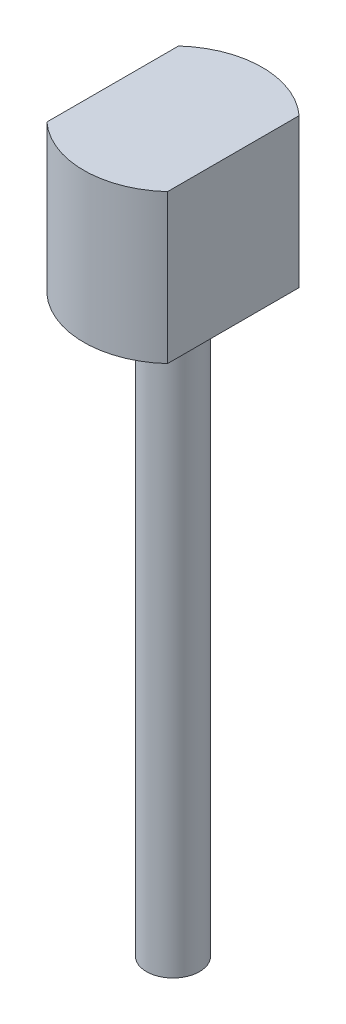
from build123d import *

# Parameters (mm, degrees)
BOSS_EXTRUDE1_DEPTH = 5.84
SKETCH2_R           = 1.0414
BOSS_EXTRUDE2_DEPTH = 22.6


with BuildPart() as part:
    # Sketch1 → Boss-Extrude1 (new body)
    with BuildSketch(Plane(origin=(0, 0, 0), x_dir=(1, 0, 0), z_dir=(0, 1, 0))):
        with BuildLine():
            Line((-2.365, -2.580072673), (-2.365, 2.580072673))
            ThreePointArc((-2.365, 2.580072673), (0, 3.5), (2.365, 2.580072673))
            Line((2.365, 2.580072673), (2.365, -2.580072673))
            ThreePointArc((2.365, -2.580072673), (0, -3.5), (-2.365, -2.580072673))
        make_face()
    extrude(amount=BOSS_EXTRUDE1_DEPTH)

    # Sketch2 → Boss-Extrude2 (add)
    with BuildSketch(Plane.XZ):
        with Locations(Location((0, 0, 0), (0, 0, 90))):
            Circle(SKETCH2_R)
    extrude(amount=BOSS_EXTRUDE2_DEPTH)


solid = part.part
